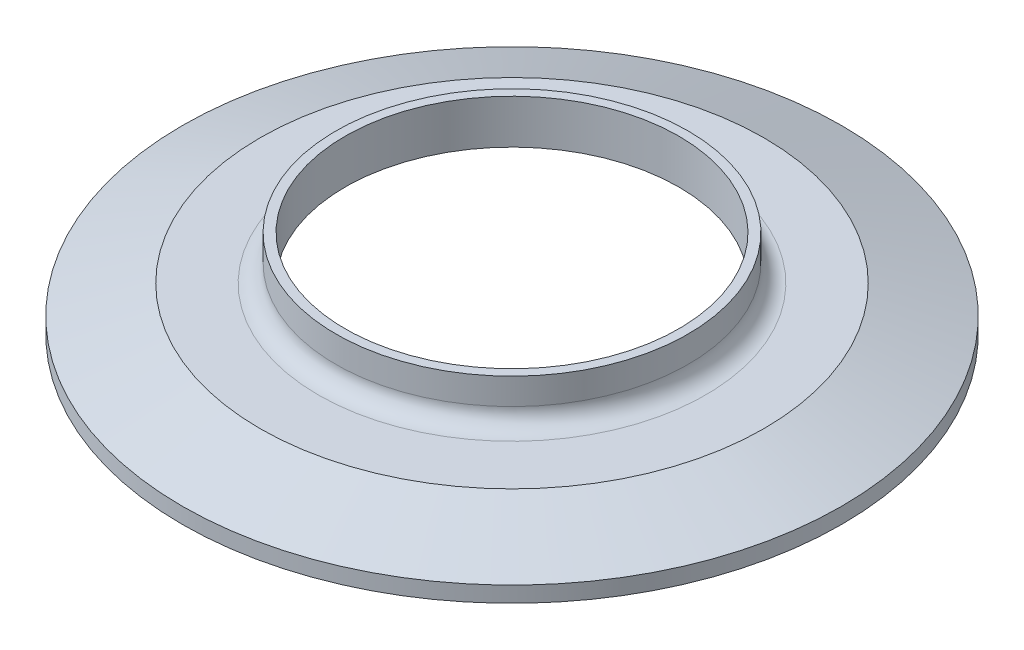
ISO-10303-21;
HEADER;
FILE_DESCRIPTION(('STEP AP214'),'2;1');
FILE_NAME('part.step','',(''),(''),'','','');
FILE_SCHEMA(('AUTOMOTIVE_DESIGN { 1 0 10303 214 1 1 1 1 }'));
ENDSEC;
DATA;
#1=APPLICATION_CONTEXT('core data for automotive mechanical design processes');
#2=APPLICATION_PROTOCOL_DEFINITION('international standard','automotive_design',2000,#1);
#3=PRODUCT_CONTEXT('',#1,'mechanical');
#4=PRODUCT('Part','Part','',(#3));
#5=PRODUCT_RELATED_PRODUCT_CATEGORY('part','',(#4));
#6=PRODUCT_DEFINITION_FORMATION('','',#4);
#7=PRODUCT_DEFINITION_CONTEXT('part definition',#1,'design');
#8=PRODUCT_DEFINITION('design','',#6,#7);
#9=PRODUCT_DEFINITION_SHAPE('','',#8);
#10=(LENGTH_UNIT() NAMED_UNIT(*) SI_UNIT(.MILLI.,.METRE.));
#11=(NAMED_UNIT(*) PLANE_ANGLE_UNIT() SI_UNIT($,.RADIAN.));
#12=(NAMED_UNIT(*) SI_UNIT($,.STERADIAN.) SOLID_ANGLE_UNIT());
#13=UNCERTAINTY_MEASURE_WITH_UNIT(LENGTH_MEASURE(1.E-05),#10,'distance_accuracy_value','');
#14=(GEOMETRIC_REPRESENTATION_CONTEXT(3) GLOBAL_UNCERTAINTY_ASSIGNED_CONTEXT((#13)) GLOBAL_UNIT_ASSIGNED_CONTEXT((#10,
#11,#12)) REPRESENTATION_CONTEXT('',''));
#15=CARTESIAN_POINT('',(0.,0.,0.));
#16=DIRECTION('',(0.,0.,1.));
#17=DIRECTION('',(1.,0.,0.));
#18=AXIS2_PLACEMENT_3D('',#15,#16,#17);
#19=CARTESIAN_POINT('',(-30.099,15.875,0.));
#20=DIRECTION('',(0.,-1.,0.));
#21=DIRECTION('',(0.,0.,-1.));
#22=AXIS2_PLACEMENT_3D('',#19,#20,#21);
#23=PLANE('',#22);
#24=CARTESIAN_POINT('',(0.,15.875,0.));
#25=DIRECTION('',(0.,-1.,0.));
#26=DIRECTION('',(0.,0.,-1.));
#27=AXIS2_PLACEMENT_3D('',#24,#25,#26);
#28=CIRCLE('',#27,31.75);
#29=CARTESIAN_POINT('',(0.,15.875,-31.75));
#30=VERTEX_POINT('',#29);
#31=EDGE_CURVE('E10',#30,#30,#28,.T.);
#32=ORIENTED_EDGE('',*,*,#31,.F.);
#33=EDGE_LOOP('',(#32));
#34=FACE_BOUND('',#33,.T.);
#35=CARTESIAN_POINT('',(0.,15.875,0.));
#36=DIRECTION('',(0.,-1.,0.));
#37=DIRECTION('',(0.,0.,-1.));
#38=AXIS2_PLACEMENT_3D('',#35,#36,#37);
#39=CIRCLE('',#38,30.099);
#40=CARTESIAN_POINT('',(0.,15.875,-30.099));
#41=VERTEX_POINT('',#40);
#42=EDGE_CURVE('E80',#41,#41,#39,.T.);
#43=ORIENTED_EDGE('',*,*,#42,.T.);
#44=EDGE_LOOP('',(#43));
#45=FACE_BOUND('',#44,.T.);
#46=ADVANCED_FACE('F31',(#34,#45),#23,.F.);
#47=CARTESIAN_POINT('',(0.,0.,0.));
#48=DIRECTION('',(0.,-1.,0.));
#49=DIRECTION('',(0.,0.,-1.));
#50=AXIS2_PLACEMENT_3D('',#47,#48,#49);
#51=CYLINDRICAL_SURFACE('',#50,31.75);
#52=CARTESIAN_POINT('',(0.,11.1252,0.));
#53=DIRECTION('',(0.,-1.,0.));
#54=DIRECTION('',(0.,0.,-1.));
#55=AXIS2_PLACEMENT_3D('',#52,#53,#54);
#56=CIRCLE('',#55,31.75);
#57=CARTESIAN_POINT('',(0.,11.1252,-31.75));
#58=VERTEX_POINT('',#57);
#59=EDGE_CURVE('E37',#58,#58,#56,.T.);
#60=ORIENTED_EDGE('',*,*,#59,.F.);
#61=EDGE_LOOP('',(#60));
#62=FACE_BOUND('',#61,.T.);
#63=ORIENTED_EDGE('',*,*,#31,.T.);
#64=EDGE_LOOP('',(#63));
#65=FACE_BOUND('',#64,.T.);
#66=ADVANCED_FACE('F159',(#62,#65),#51,.T.);
#67=CARTESIAN_POINT('',(0.,11.1252,0.));
#68=DIRECTION('',(0.,-1.,0.));
#69=DIRECTION('',(0.,0.,-1.));
#70=AXIS2_PLACEMENT_3D('',#67,#68,#69);
#71=TOROIDAL_SURFACE('',#70,34.925,3.175);
#72=CARTESIAN_POINT('',(0.,7.9502,0.));
#73=DIRECTION('',(0.,-1.,0.));
#74=DIRECTION('',(0.,0.,-1.));
#75=AXIS2_PLACEMENT_3D('',#72,#73,#74);
#76=CIRCLE('',#75,34.925);
#77=CARTESIAN_POINT('',(0.,7.9502,-34.925));
#78=VERTEX_POINT('',#77);
#79=EDGE_CURVE('E41',#78,#78,#76,.T.);
#80=ORIENTED_EDGE('',*,*,#79,.F.);
#81=EDGE_LOOP('',(#80));
#82=FACE_BOUND('',#81,.T.);
#83=ORIENTED_EDGE('',*,*,#59,.T.);
#84=EDGE_LOOP('',(#83));
#85=FACE_BOUND('',#84,.T.);
#86=ADVANCED_FACE('F154',(#82,#85),#71,.F.);
#87=CARTESIAN_POINT('',(-34.925,7.9502,0.));
#88=DIRECTION('',(0.,-1.,0.));
#89=DIRECTION('',(0.,0.,-1.));
#90=AXIS2_PLACEMENT_3D('',#87,#88,#89);
#91=PLANE('',#90);
#92=CARTESIAN_POINT('',(0.,7.9502,0.));
#93=DIRECTION('',(0.,-1.,0.));
#94=DIRECTION('',(0.,0.,-1.));
#95=AXIS2_PLACEMENT_3D('',#92,#93,#94);
#96=CIRCLE('',#95,45.4344287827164);
#97=CARTESIAN_POINT('',(0.,7.9502,-45.4344287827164));
#98=VERTEX_POINT('',#97);
#99=EDGE_CURVE('E45',#98,#98,#96,.T.);
#100=ORIENTED_EDGE('',*,*,#99,.F.);
#101=EDGE_LOOP('',(#100));
#102=FACE_BOUND('',#101,.T.);
#103=ORIENTED_EDGE('',*,*,#79,.T.);
#104=EDGE_LOOP('',(#103));
#105=FACE_BOUND('',#104,.T.);
#106=ADVANCED_FACE('F148',(#102,#105),#91,.F.);
#107=CARTESIAN_POINT('',(0.,7.9502,0.));
#108=DIRECTION('',(0.,-1.,0.));
#109=DIRECTION('',(0.,0.,-1.));
#110=AXIS2_PLACEMENT_3D('',#107,#108,#109);
#111=CONICAL_SURFACE('',#110,45.4344287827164,1.22173047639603);
#112=CARTESIAN_POINT('',(0.,2.8448,0.));
#113=DIRECTION('',(0.,-1.,0.));
#114=DIRECTION('',(0.,0.,-1.));
#115=AXIS2_PLACEMENT_3D('',#112,#113,#114);
#116=CIRCLE('',#115,59.4614);
#117=CARTESIAN_POINT('',(0.,2.8448,-59.4614));
#118=VERTEX_POINT('',#117);
#119=EDGE_CURVE('E50',#118,#118,#116,.T.);
#120=ORIENTED_EDGE('',*,*,#119,.F.);
#121=EDGE_LOOP('',(#120));
#122=FACE_BOUND('',#121,.T.);
#123=ORIENTED_EDGE('',*,*,#99,.T.);
#124=EDGE_LOOP('',(#123));
#125=FACE_BOUND('',#124,.T.);
#126=ADVANCED_FACE('F142',(#122,#125),#111,.T.);
#127=CARTESIAN_POINT('',(0.,0.,0.));
#128=DIRECTION('',(0.,-1.,0.));
#129=DIRECTION('',(0.,0.,-1.));
#130=AXIS2_PLACEMENT_3D('',#127,#128,#129);
#131=CYLINDRICAL_SURFACE('',#130,59.4614);
#132=CARTESIAN_POINT('',(0.,0.,0.));
#133=DIRECTION('',(0.,-1.,0.));
#134=DIRECTION('',(0.,0.,-1.));
#135=AXIS2_PLACEMENT_3D('',#132,#133,#134);
#136=CIRCLE('',#135,59.4614);
#137=CARTESIAN_POINT('',(0.,0.,-59.4614));
#138=VERTEX_POINT('',#137);
#139=EDGE_CURVE('E53',#138,#138,#136,.T.);
#140=ORIENTED_EDGE('',*,*,#139,.F.);
#141=EDGE_LOOP('',(#140));
#142=FACE_BOUND('',#141,.T.);
#143=ORIENTED_EDGE('',*,*,#119,.T.);
#144=EDGE_LOOP('',(#143));
#145=FACE_BOUND('',#144,.T.);
#146=ADVANCED_FACE('F136',(#142,#145),#131,.T.);
#147=CARTESIAN_POINT('',(-59.4614,0.,0.));
#148=DIRECTION('',(0.,1.,0.));
#149=DIRECTION('',(0.,0.,1.));
#150=AXIS2_PLACEMENT_3D('',#147,#148,#149);
#151=PLANE('',#150);
#152=CARTESIAN_POINT('',(0.,0.,0.));
#153=DIRECTION('',(0.,-1.,0.));
#154=DIRECTION('',(0.,0.,-1.));
#155=AXIS2_PLACEMENT_3D('',#152,#153,#154);
#156=CIRCLE('',#155,56.924857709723);
#157=CARTESIAN_POINT('',(0.,0.,-56.924857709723));
#158=VERTEX_POINT('',#157);
#159=EDGE_CURVE('E56',#158,#158,#156,.T.);
#160=ORIENTED_EDGE('',*,*,#159,.F.);
#161=EDGE_LOOP('',(#160));
#162=FACE_BOUND('',#161,.T.);
#163=ORIENTED_EDGE('',*,*,#139,.T.);
#164=EDGE_LOOP('',(#163));
#165=FACE_BOUND('',#164,.T.);
#166=ADVANCED_FACE('F130',(#162,#165),#151,.F.);
#167=CARTESIAN_POINT('',(0.,0.776719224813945,0.));
#168=DIRECTION('',(0.,-1.,0.));
#169=DIRECTION('',(0.,0.,-1.));
#170=AXIS2_PLACEMENT_3D('',#167,#168,#169);
#171=TOROIDAL_SURFACE('',#170,56.7956059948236,0.787400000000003);
#172=CARTESIAN_POINT('',(0.,0.469057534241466,0.));
#173=DIRECTION('',(0.,-1.,0.));
#174=DIRECTION('',(0.,0.,-1.));
#175=AXIS2_PLACEMENT_3D('',#172,#173,#174);
#176=CIRCLE('',#175,56.0708004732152);
#177=CARTESIAN_POINT('',(0.,0.469057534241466,-56.0708004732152));
#178=VERTEX_POINT('',#177);
#179=EDGE_CURVE('E59',#178,#178,#176,.T.);
#180=ORIENTED_EDGE('',*,*,#179,.F.);
#181=EDGE_LOOP('',(#180));
#182=FACE_BOUND('',#181,.T.);
#183=ORIENTED_EDGE('',*,*,#159,.T.);
#184=EDGE_LOOP('',(#183));
#185=FACE_BOUND('',#184,.T.);
#186=ADVANCED_FACE('F124',(#182,#185),#171,.T.);
#187=CARTESIAN_POINT('',(0.,0.469057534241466,0.));
#188=DIRECTION('',(0.,-1.,0.));
#189=DIRECTION('',(0.,0.,-1.));
#190=AXIS2_PLACEMENT_3D('',#187,#188,#189);
#191=CONICAL_SURFACE('',#190,56.0708004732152,0.401425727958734);
#192=CARTESIAN_POINT('',(0.,0.872854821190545,0.));
#193=DIRECTION('',(0.,-1.,0.));
#194=DIRECTION('',(0.,0.,-1.));
#195=AXIS2_PLACEMENT_3D('',#192,#193,#194);
#196=CIRCLE('',#195,55.8993986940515);
#197=CARTESIAN_POINT('',(0.,0.872854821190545,-55.8993986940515));
#198=VERTEX_POINT('',#197);
#199=EDGE_CURVE('E62',#198,#198,#196,.T.);
#200=ORIENTED_EDGE('',*,*,#199,.F.);
#201=EDGE_LOOP('',(#200));
#202=FACE_BOUND('',#201,.T.);
#203=ORIENTED_EDGE('',*,*,#179,.T.);
#204=EDGE_LOOP('',(#203));
#205=FACE_BOUND('',#204,.T.);
#206=ADVANCED_FACE('F118',(#202,#205),#191,.F.);
#207=CARTESIAN_POINT('',(0.,0.4064,0.));
#208=DIRECTION('',(0.,-1.,0.));
#209=DIRECTION('',(0.,0.,-1.));
#210=AXIS2_PLACEMENT_3D('',#207,#208,#209);
#211=TOROIDAL_SURFACE('',#210,54.8005,1.1938);
#212=CARTESIAN_POINT('',(0.,0.872854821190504,0.));
#213=DIRECTION('',(0.,-1.,0.));
#214=DIRECTION('',(0.,0.,-1.));
#215=AXIS2_PLACEMENT_3D('',#212,#213,#214);
#216=CIRCLE('',#215,53.7016013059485);
#217=CARTESIAN_POINT('',(0.,0.872854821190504,-53.7016013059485));
#218=VERTEX_POINT('',#217);
#219=EDGE_CURVE('E65',#218,#218,#216,.T.);
#220=ORIENTED_EDGE('',*,*,#219,.F.);
#221=EDGE_LOOP('',(#220));
#222=FACE_BOUND('',#221,.T.);
#223=ORIENTED_EDGE('',*,*,#199,.T.);
#224=EDGE_LOOP('',(#223));
#225=FACE_BOUND('',#224,.T.);
#226=ADVANCED_FACE('F112',(#222,#225),#211,.F.);
#227=CARTESIAN_POINT('',(0.,0.872854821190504,0.));
#228=DIRECTION('',(0.,1.,0.));
#229=DIRECTION('',(0.,0.,1.));
#230=AXIS2_PLACEMENT_3D('',#227,#228,#229);
#231=CONICAL_SURFACE('',#230,53.7016013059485,0.401425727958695);
#232=CARTESIAN_POINT('',(0.,0.479738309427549,0.));
#233=DIRECTION('',(0.,-1.,0.));
#234=DIRECTION('',(0.,0.,-1.));
#235=AXIS2_PLACEMENT_3D('',#232,#233,#234);
#236=CIRCLE('',#235,53.5347332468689);
#237=CARTESIAN_POINT('',(0.,0.479738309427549,-53.5347332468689));
#238=VERTEX_POINT('',#237);
#239=EDGE_CURVE('E68',#238,#238,#236,.T.);
#240=ORIENTED_EDGE('',*,*,#239,.F.);
#241=EDGE_LOOP('',(#240));
#242=FACE_BOUND('',#241,.T.);
#243=ORIENTED_EDGE('',*,*,#219,.T.);
#244=EDGE_LOOP('',(#243));
#245=FACE_BOUND('',#244,.T.);
#246=ADVANCED_FACE('F106',(#242,#245),#231,.T.);
#247=CARTESIAN_POINT('',(0.,0.787400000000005,0.));
#248=DIRECTION('',(0.,-1.,0.));
#249=DIRECTION('',(0.,0.,-1.));
#250=AXIS2_PLACEMENT_3D('',#247,#248,#249);
#251=TOROIDAL_SURFACE('',#250,52.8099277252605,0.787399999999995);
#252=CARTESIAN_POINT('',(0.,0.,0.));
#253=DIRECTION('',(0.,-1.,0.));
#254=DIRECTION('',(0.,0.,-1.));
#255=AXIS2_PLACEMENT_3D('',#252,#253,#254);
#256=CIRCLE('',#255,52.8099277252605);
#257=CARTESIAN_POINT('',(0.,0.,-52.8099277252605));
#258=VERTEX_POINT('',#257);
#259=EDGE_CURVE('E71',#258,#258,#256,.T.);
#260=ORIENTED_EDGE('',*,*,#259,.F.);
#261=EDGE_LOOP('',(#260));
#262=FACE_BOUND('',#261,.T.);
#263=ORIENTED_EDGE('',*,*,#239,.T.);
#264=EDGE_LOOP('',(#263));
#265=FACE_BOUND('',#264,.T.);
#266=ADVANCED_FACE('F100',(#262,#265),#251,.T.);
#267=CARTESIAN_POINT('',(-48.6918,0.,0.));
#268=DIRECTION('',(0.,1.,0.));
#269=DIRECTION('',(0.,0.,1.));
#270=AXIS2_PLACEMENT_3D('',#267,#268,#269);
#271=PLANE('',#270);
#272=CARTESIAN_POINT('',(0.,0.,0.));
#273=DIRECTION('',(0.,-1.,0.));
#274=DIRECTION('',(0.,0.,-1.));
#275=AXIS2_PLACEMENT_3D('',#272,#273,#274);
#276=CIRCLE('',#275,48.6918);
#277=CARTESIAN_POINT('',(0.,0.,-48.6918));
#278=VERTEX_POINT('',#277);
#279=EDGE_CURVE('E74',#278,#278,#276,.T.);
#280=ORIENTED_EDGE('',*,*,#279,.F.);
#281=EDGE_LOOP('',(#280));
#282=FACE_BOUND('',#281,.T.);
#283=ORIENTED_EDGE('',*,*,#259,.T.);
#284=EDGE_LOOP('',(#283));
#285=FACE_BOUND('',#284,.T.);
#286=ADVANCED_FACE('F94',(#282,#285),#271,.F.);
#287=CARTESIAN_POINT('',(0.,0.,0.));
#288=DIRECTION('',(0.,-1.,0.));
#289=DIRECTION('',(0.,0.,-1.));
#290=AXIS2_PLACEMENT_3D('',#287,#288,#289);
#291=CONICAL_SURFACE('',#290,48.6918,1.16797433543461);
#292=CARTESIAN_POINT('',(0.,7.92283152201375,0.));
#293=DIRECTION('',(0.,-1.,0.));
#294=DIRECTION('',(0.,0.,-1.));
#295=AXIS2_PLACEMENT_3D('',#292,#293,#294);
#296=CIRCLE('',#295,30.099);
#297=CARTESIAN_POINT('',(0.,7.92283152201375,-30.099));
#298=VERTEX_POINT('',#297);
#299=EDGE_CURVE('E77',#298,#298,#296,.T.);
#300=ORIENTED_EDGE('',*,*,#299,.F.);
#301=EDGE_LOOP('',(#300));
#302=FACE_BOUND('',#301,.T.);
#303=ORIENTED_EDGE('',*,*,#279,.T.);
#304=EDGE_LOOP('',(#303));
#305=FACE_BOUND('',#304,.T.);
#306=ADVANCED_FACE('F88',(#302,#305),#291,.F.);
#307=CARTESIAN_POINT('',(0.,0.,0.));
#308=DIRECTION('',(0.,-1.,0.));
#309=DIRECTION('',(0.,0.,-1.));
#310=AXIS2_PLACEMENT_3D('',#307,#308,#309);
#311=CYLINDRICAL_SURFACE('',#310,30.099);
#312=ORIENTED_EDGE('',*,*,#42,.F.);
#313=EDGE_LOOP('',(#312));
#314=FACE_BOUND('',#313,.T.);
#315=ORIENTED_EDGE('',*,*,#299,.T.);
#316=EDGE_LOOP('',(#315));
#317=FACE_BOUND('',#316,.T.);
#318=ADVANCED_FACE('F85',(#314,#317),#311,.F.);
#319=CLOSED_SHELL('',(#46,#66,#86,#106,#126,#146,#166,#186,#206,#226,#246,#266,#286,#306,#318));
#320=MANIFOLD_SOLID_BREP('B2',#319);
#321=ADVANCED_BREP_SHAPE_REPRESENTATION('',(#18,#320),#14);
#322=SHAPE_DEFINITION_REPRESENTATION(#9,#321);
ENDSEC;
END-ISO-10303-21;
